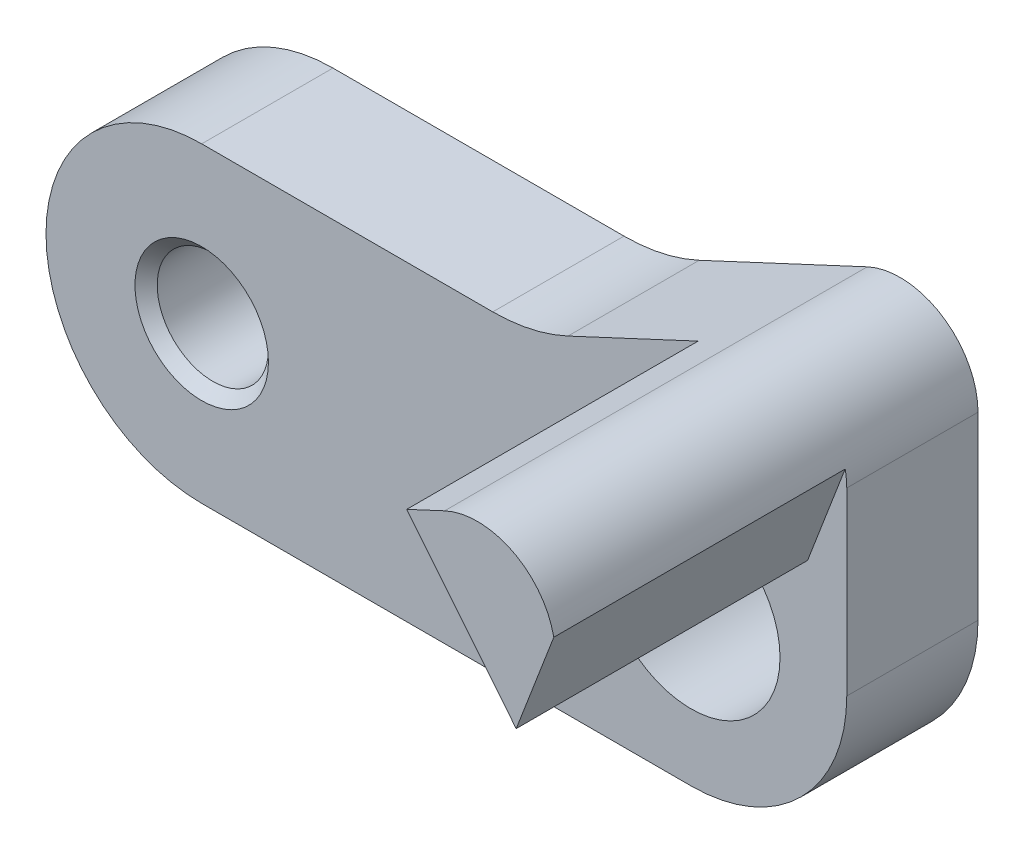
ISO-10303-21;
HEADER;
FILE_DESCRIPTION(('STEP AP214'),'2;1');
FILE_NAME('part.step','',(''),(''),'','','');
FILE_SCHEMA(('AUTOMOTIVE_DESIGN { 1 0 10303 214 1 1 1 1 }'));
ENDSEC;
DATA;
#1=APPLICATION_CONTEXT('core data for automotive mechanical design processes');
#2=APPLICATION_PROTOCOL_DEFINITION('international standard','automotive_design',2000,#1);
#3=PRODUCT_CONTEXT('',#1,'mechanical');
#4=PRODUCT('Part','Part','',(#3));
#5=PRODUCT_RELATED_PRODUCT_CATEGORY('part','',(#4));
#6=PRODUCT_DEFINITION_FORMATION('','',#4);
#7=PRODUCT_DEFINITION_CONTEXT('part definition',#1,'design');
#8=PRODUCT_DEFINITION('design','',#6,#7);
#9=PRODUCT_DEFINITION_SHAPE('','',#8);
#10=(LENGTH_UNIT() NAMED_UNIT(*) SI_UNIT(.MILLI.,.METRE.));
#11=(NAMED_UNIT(*) PLANE_ANGLE_UNIT() SI_UNIT($,.RADIAN.));
#12=(NAMED_UNIT(*) SI_UNIT($,.STERADIAN.) SOLID_ANGLE_UNIT());
#13=UNCERTAINTY_MEASURE_WITH_UNIT(LENGTH_MEASURE(1.E-05),#10,'distance_accuracy_value','');
#14=(GEOMETRIC_REPRESENTATION_CONTEXT(3) GLOBAL_UNCERTAINTY_ASSIGNED_CONTEXT((#13)) GLOBAL_UNIT_ASSIGNED_CONTEXT((#10,
#11,#12)) REPRESENTATION_CONTEXT('',''));
#15=CARTESIAN_POINT('',(0.,0.,0.));
#16=DIRECTION('',(0.,0.,1.));
#17=DIRECTION('',(1.,0.,0.));
#18=AXIS2_PLACEMENT_3D('',#15,#16,#17);
#19=CARTESIAN_POINT('',(1.75,4.05,2.95));
#20=DIRECTION('',(0.,0.,-1.));
#21=DIRECTION('',(-1.,0.,0.));
#22=AXIS2_PLACEMENT_3D('',#19,#20,#21);
#23=PLANE('',#22);
#24=CARTESIAN_POINT('',(-11.,0.,2.95));
#25=DIRECTION('',(0.,0.,1.));
#26=DIRECTION('',(1.,0.,0.));
#27=AXIS2_PLACEMENT_3D('',#24,#25,#26);
#28=CIRCLE('',#27,1.5);
#29=CARTESIAN_POINT('',(-9.5,0.,2.95));
#30=VERTEX_POINT('',#29);
#31=EDGE_CURVE('E289',#30,#30,#28,.T.);
#32=ORIENTED_EDGE('',*,*,#31,.F.);
#33=EDGE_LOOP('',(#32));
#34=FACE_BOUND('',#33,.T.);
#35=CARTESIAN_POINT('',(0.,0.,2.95));
#36=DIRECTION('',(0.,0.,1.));
#37=DIRECTION('',(1.,0.,0.));
#38=AXIS2_PLACEMENT_3D('',#35,#36,#37);
#39=CIRCLE('',#38,2.);
#40=CARTESIAN_POINT('',(2.,0.,2.95));
#41=VERTEX_POINT('',#40);
#42=EDGE_CURVE('E167',#41,#41,#39,.T.);
#43=ORIENTED_EDGE('',*,*,#42,.F.);
#44=EDGE_LOOP('',(#43));
#45=FACE_BOUND('',#44,.T.);
#46=DIRECTION('',(0.35836794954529,0.933580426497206,0.));
#47=VECTOR('',#46,1.);
#48=CARTESIAN_POINT('',(2.61919284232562,2.2,2.95));
#49=LINE('',#48,#47);
#50=CARTESIAN_POINT('',(2.61919284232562,2.2,2.95));
#51=VERTEX_POINT('',#50);
#52=CARTESIAN_POINT('',(3.46431281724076,4.40161280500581,2.95));
#53=VERTEX_POINT('',#52);
#54=EDGE_CURVE('E107',#51,#53,#49,.T.);
#55=ORIENTED_EDGE('',*,*,#54,.F.);
#56=DIRECTION('',(0.629320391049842,-0.777145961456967,0.));
#57=VECTOR('',#56,1.);
#58=CARTESIAN_POINT('',(0.158452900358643,5.23876075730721,2.95));
#59=LINE('',#58,#57);
#60=CARTESIAN_POINT('',(0.158452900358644,5.23876075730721,2.95));
#61=VERTEX_POINT('',#60);
#62=EDGE_CURVE('E43',#61,#51,#59,.T.);
#63=ORIENTED_EDGE('',*,*,#62,.F.);
#64=DIRECTION('',(-0.906307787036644,-0.422618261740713,0.));
#65=VECTOR('',#64,1.);
#66=CARTESIAN_POINT('',(-2.7666371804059,3.87476885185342,2.95));
#67=LINE('',#66,#65);
#68=CARTESIAN_POINT('',(-2.7666371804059,3.87476885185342,2.95));
#69=VERTEX_POINT('',#68);
#70=EDGE_CURVE('E156',#61,#69,#67,.T.);
#71=ORIENTED_EDGE('',*,*,#70,.T.);
#72=CARTESIAN_POINT('',(-4.45711022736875,7.5,2.95));
#73=DIRECTION('',(0.,0.,-1.));
#74=DIRECTION('',(1.,0.,0.));
#75=AXIS2_PLACEMENT_3D('',#72,#73,#74);
#76=CIRCLE('',#75,4.);
#77=CARTESIAN_POINT('',(-4.45711022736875,3.5,2.95));
#78=VERTEX_POINT('',#77);
#79=EDGE_CURVE('E158',#69,#78,#76,.T.);
#80=ORIENTED_EDGE('',*,*,#79,.T.);
#81=DIRECTION('',(-1.,0.,0.));
#82=VECTOR('',#81,1.);
#83=CARTESIAN_POINT('',(-11.,3.5,2.95));
#84=LINE('',#83,#82);
#85=CARTESIAN_POINT('',(-11.,3.5,2.95));
#86=VERTEX_POINT('',#85);
#87=EDGE_CURVE('E187',#78,#86,#84,.T.);
#88=ORIENTED_EDGE('',*,*,#87,.T.);
#89=CARTESIAN_POINT('',(-11.,0.,2.95));
#90=DIRECTION('',(0.,0.,1.));
#91=DIRECTION('',(1.,0.,0.));
#92=AXIS2_PLACEMENT_3D('',#89,#90,#91);
#93=CIRCLE('',#92,3.5);
#94=CARTESIAN_POINT('',(-11.,-3.5,2.95));
#95=VERTEX_POINT('',#94);
#96=EDGE_CURVE('E201',#86,#95,#93,.T.);
#97=ORIENTED_EDGE('',*,*,#96,.T.);
#98=DIRECTION('',(1.,0.,0.));
#99=VECTOR('',#98,1.);
#100=CARTESIAN_POINT('',(0.,-3.5,2.95));
#101=LINE('',#100,#99);
#102=CARTESIAN_POINT('',(0.,-3.5,2.95));
#103=VERTEX_POINT('',#102);
#104=EDGE_CURVE('E203',#95,#103,#101,.T.);
#105=ORIENTED_EDGE('',*,*,#104,.T.);
#106=CARTESIAN_POINT('',(0.,0.,2.95));
#107=DIRECTION('',(0.,0.,1.));
#108=DIRECTION('',(1.,0.,0.));
#109=AXIS2_PLACEMENT_3D('',#106,#107,#108);
#110=CIRCLE('',#109,3.5);
#111=CARTESIAN_POINT('',(3.5,0.,2.95));
#112=VERTEX_POINT('',#111);
#113=EDGE_CURVE('E207',#103,#112,#110,.T.);
#114=ORIENTED_EDGE('',*,*,#113,.T.);
#115=DIRECTION('',(0.,1.,0.));
#116=VECTOR('',#115,1.);
#117=CARTESIAN_POINT('',(3.5,0.,2.95));
#118=LINE('',#117,#116);
#119=CARTESIAN_POINT('',(3.5,4.05,2.95));
#120=VERTEX_POINT('',#119);
#121=EDGE_CURVE('E209',#112,#120,#118,.T.);
#122=ORIENTED_EDGE('',*,*,#121,.T.);
#123=CARTESIAN_POINT('',(1.75,4.05,2.95));
#124=DIRECTION('',(0.,0.,1.));
#125=DIRECTION('',(-1.,0.,0.));
#126=AXIS2_PLACEMENT_3D('',#123,#124,#125);
#127=CIRCLE('',#126,1.75);
#128=EDGE_CURVE('E49',#120,#53,#127,.T.);
#129=ORIENTED_EDGE('',*,*,#128,.T.);
#130=EDGE_LOOP('',(#55,#63,#71,#80,#88,#97,#105,#114,#122,#129));
#131=FACE_BOUND('',#130,.T.);
#132=ADVANCED_FACE('F26',(#34,#45,#131),#23,.F.);
#133=CARTESIAN_POINT('',(1.75,4.05,2.95));
#134=DIRECTION('',(0.,0.,-1.));
#135=DIRECTION('',(-1.,0.,0.));
#136=AXIS2_PLACEMENT_3D('',#133,#134,#135);
#137=CYLINDRICAL_SURFACE('',#136,1.75);
#138=CARTESIAN_POINT('',(1.75,4.05,0.));
#139=DIRECTION('',(0.,0.,1.));
#140=DIRECTION('',(-1.,0.,0.));
#141=AXIS2_PLACEMENT_3D('',#138,#139,#140);
#142=CIRCLE('',#141,1.75);
#143=CARTESIAN_POINT('',(3.5,4.05,0.));
#144=VERTEX_POINT('',#143);
#145=CARTESIAN_POINT('',(1.01041804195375,5.63603862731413,0.));
#146=VERTEX_POINT('',#145);
#147=EDGE_CURVE('E128',#144,#146,#142,.T.);
#148=ORIENTED_EDGE('',*,*,#147,.T.);
#149=DIRECTION('',(0.,0.,-1.));
#150=VECTOR('',#149,1.);
#151=CARTESIAN_POINT('',(1.01041804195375,5.63603862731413,2.95));
#152=LINE('',#151,#150);
#153=CARTESIAN_POINT('',(1.01041804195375,5.63603862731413,9.5));
#154=VERTEX_POINT('',#153);
#155=EDGE_CURVE('E11',#154,#146,#152,.T.);
#156=ORIENTED_EDGE('',*,*,#155,.F.);
#157=CARTESIAN_POINT('',(1.75,4.05,9.5));
#158=DIRECTION('',(0.,0.,1.));
#159=DIRECTION('',(1.,0.,0.));
#160=AXIS2_PLACEMENT_3D('',#157,#158,#159);
#161=CIRCLE('',#160,1.75);
#162=CARTESIAN_POINT('',(3.46431281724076,4.40161280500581,9.5));
#163=VERTEX_POINT('',#162);
#164=EDGE_CURVE('E112',#163,#154,#161,.T.);
#165=ORIENTED_EDGE('',*,*,#164,.F.);
#166=DIRECTION('',(0.,0.,-1.));
#167=VECTOR('',#166,1.);
#168=CARTESIAN_POINT('',(3.46431281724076,4.40161280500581,9.5));
#169=LINE('',#168,#167);
#170=EDGE_CURVE('E126',#163,#53,#169,.T.);
#171=ORIENTED_EDGE('',*,*,#170,.T.);
#172=ORIENTED_EDGE('',*,*,#128,.F.);
#173=DIRECTION('',(0.,0.,-1.));
#174=VECTOR('',#173,1.);
#175=CARTESIAN_POINT('',(3.5,4.05,2.95));
#176=LINE('',#175,#174);
#177=EDGE_CURVE('E211',#120,#144,#176,.T.);
#178=ORIENTED_EDGE('',*,*,#177,.T.);
#179=EDGE_LOOP('',(#148,#156,#165,#171,#172,#178));
#180=FACE_BOUND('',#179,.T.);
#181=ADVANCED_FACE('F28',(#180),#137,.T.);
#182=CARTESIAN_POINT('',(-2.7666371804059,3.87476885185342,2.95));
#183=DIRECTION('',(0.422618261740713,-0.906307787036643,0.));
#184=DIRECTION('',(0.906307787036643,0.422618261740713,0.));
#185=AXIS2_PLACEMENT_3D('',#182,#183,#184);
#186=PLANE('',#185);
#187=DIRECTION('',(-0.906307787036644,-0.422618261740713,0.));
#188=VECTOR('',#187,1.);
#189=CARTESIAN_POINT('',(-2.7666371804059,3.87476885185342,0.));
#190=LINE('',#189,#188);
#191=CARTESIAN_POINT('',(-2.7666371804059,3.87476885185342,0.));
#192=VERTEX_POINT('',#191);
#193=EDGE_CURVE('E136',#146,#192,#190,.T.);
#194=ORIENTED_EDGE('',*,*,#193,.T.);
#195=DIRECTION('',(0.,0.,-1.));
#196=VECTOR('',#195,1.);
#197=CARTESIAN_POINT('',(-2.7666371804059,3.87476885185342,2.95));
#198=LINE('',#197,#196);
#199=EDGE_CURVE('E35',#69,#192,#198,.T.);
#200=ORIENTED_EDGE('',*,*,#199,.F.);
#201=ORIENTED_EDGE('',*,*,#70,.F.);
#202=DIRECTION('',(0.,0.,-1.));
#203=VECTOR('',#202,1.);
#204=CARTESIAN_POINT('',(0.158452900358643,5.23876075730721,9.5));
#205=LINE('',#204,#203);
#206=CARTESIAN_POINT('',(0.158452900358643,5.23876075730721,9.5));
#207=VERTEX_POINT('',#206);
#208=EDGE_CURVE('E122',#207,#61,#205,.T.);
#209=ORIENTED_EDGE('',*,*,#208,.F.);
#210=DIRECTION('',(-0.906307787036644,-0.422618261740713,0.));
#211=VECTOR('',#210,1.);
#212=CARTESIAN_POINT('',(1.01041804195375,5.63603862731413,9.5));
#213=LINE('',#212,#211);
#214=EDGE_CURVE('E171',#154,#207,#213,.T.);
#215=ORIENTED_EDGE('',*,*,#214,.F.);
#216=ORIENTED_EDGE('',*,*,#155,.T.);
#217=EDGE_LOOP('',(#194,#200,#201,#209,#215,#216));
#218=FACE_BOUND('',#217,.T.);
#219=ADVANCED_FACE('F181',(#218),#186,.F.);
#220=CARTESIAN_POINT('',(-4.45711022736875,7.5,2.95));
#221=DIRECTION('',(0.,0.,-1.));
#222=DIRECTION('',(-1.,0.,0.));
#223=AXIS2_PLACEMENT_3D('',#220,#221,#222);
#224=CYLINDRICAL_SURFACE('',#223,4.);
#225=CARTESIAN_POINT('',(-4.45711022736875,7.5,0.));
#226=DIRECTION('',(0.,0.,-1.));
#227=DIRECTION('',(1.,0.,0.));
#228=AXIS2_PLACEMENT_3D('',#225,#226,#227);
#229=CIRCLE('',#228,4.);
#230=CARTESIAN_POINT('',(-4.45711022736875,3.5,0.));
#231=VERTEX_POINT('',#230);
#232=EDGE_CURVE('E138',#192,#231,#229,.T.);
#233=ORIENTED_EDGE('',*,*,#232,.T.);
#234=DIRECTION('',(0.,0.,-1.));
#235=VECTOR('',#234,1.);
#236=CARTESIAN_POINT('',(-4.45711022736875,3.5,2.95));
#237=LINE('',#236,#235);
#238=EDGE_CURVE('E191',#78,#231,#237,.T.);
#239=ORIENTED_EDGE('',*,*,#238,.F.);
#240=ORIENTED_EDGE('',*,*,#79,.F.);
#241=ORIENTED_EDGE('',*,*,#199,.T.);
#242=EDGE_LOOP('',(#233,#239,#240,#241));
#243=FACE_BOUND('',#242,.T.);
#244=ADVANCED_FACE('F192',(#243),#224,.F.);
#245=CARTESIAN_POINT('',(-11.,3.5,2.95));
#246=DIRECTION('',(0.,-1.,0.));
#247=DIRECTION('',(0.,0.,-1.));
#248=AXIS2_PLACEMENT_3D('',#245,#246,#247);
#249=PLANE('',#248);
#250=DIRECTION('',(-1.,0.,0.));
#251=VECTOR('',#250,1.);
#252=CARTESIAN_POINT('',(-11.,3.5,0.));
#253=LINE('',#252,#251);
#254=CARTESIAN_POINT('',(-11.,3.5,0.));
#255=VERTEX_POINT('',#254);
#256=EDGE_CURVE('E140',#231,#255,#253,.T.);
#257=ORIENTED_EDGE('',*,*,#256,.T.);
#258=DIRECTION('',(0.,0.,-1.));
#259=VECTOR('',#258,1.);
#260=CARTESIAN_POINT('',(-11.,3.5,2.95));
#261=LINE('',#260,#259);
#262=EDGE_CURVE('E196',#86,#255,#261,.T.);
#263=ORIENTED_EDGE('',*,*,#262,.F.);
#264=ORIENTED_EDGE('',*,*,#87,.F.);
#265=ORIENTED_EDGE('',*,*,#238,.T.);
#266=EDGE_LOOP('',(#257,#263,#264,#265));
#267=FACE_BOUND('',#266,.T.);
#268=ADVANCED_FACE('F198',(#267),#249,.F.);
#269=CARTESIAN_POINT('',(-11.,0.,2.95));
#270=DIRECTION('',(0.,0.,-1.));
#271=DIRECTION('',(-1.,0.,0.));
#272=AXIS2_PLACEMENT_3D('',#269,#270,#271);
#273=CYLINDRICAL_SURFACE('',#272,3.5);
#274=CARTESIAN_POINT('',(-11.,0.,0.));
#275=DIRECTION('',(0.,0.,1.));
#276=DIRECTION('',(1.,0.,0.));
#277=AXIS2_PLACEMENT_3D('',#274,#275,#276);
#278=CIRCLE('',#277,3.5);
#279=CARTESIAN_POINT('',(-11.,-3.5,0.));
#280=VERTEX_POINT('',#279);
#281=EDGE_CURVE('E142',#255,#280,#278,.T.);
#282=ORIENTED_EDGE('',*,*,#281,.T.);
#283=DIRECTION('',(0.,0.,-1.));
#284=VECTOR('',#283,1.);
#285=CARTESIAN_POINT('',(-11.,-3.5,2.95));
#286=LINE('',#285,#284);
#287=EDGE_CURVE('E219',#95,#280,#286,.T.);
#288=ORIENTED_EDGE('',*,*,#287,.F.);
#289=ORIENTED_EDGE('',*,*,#96,.F.);
#290=ORIENTED_EDGE('',*,*,#262,.T.);
#291=EDGE_LOOP('',(#282,#288,#289,#290));
#292=FACE_BOUND('',#291,.T.);
#293=ADVANCED_FACE('F227',(#292),#273,.T.);
#294=CARTESIAN_POINT('',(0.,-3.5,2.95));
#295=DIRECTION('',(0.,1.,0.));
#296=DIRECTION('',(-1.,0.,0.));
#297=AXIS2_PLACEMENT_3D('',#294,#295,#296);
#298=PLANE('',#297);
#299=DIRECTION('',(1.,0.,0.));
#300=VECTOR('',#299,1.);
#301=CARTESIAN_POINT('',(0.,-3.5,0.));
#302=LINE('',#301,#300);
#303=CARTESIAN_POINT('',(0.,-3.5,0.));
#304=VERTEX_POINT('',#303);
#305=EDGE_CURVE('E144',#280,#304,#302,.T.);
#306=ORIENTED_EDGE('',*,*,#305,.T.);
#307=DIRECTION('',(0.,0.,-1.));
#308=VECTOR('',#307,1.);
#309=CARTESIAN_POINT('',(0.,-3.5,2.95));
#310=LINE('',#309,#308);
#311=EDGE_CURVE('E216',#103,#304,#310,.T.);
#312=ORIENTED_EDGE('',*,*,#311,.F.);
#313=ORIENTED_EDGE('',*,*,#104,.F.);
#314=ORIENTED_EDGE('',*,*,#287,.T.);
#315=EDGE_LOOP('',(#306,#312,#313,#314));
#316=FACE_BOUND('',#315,.T.);
#317=ADVANCED_FACE('F234',(#316),#298,.F.);
#318=CARTESIAN_POINT('',(0.,0.,2.95));
#319=DIRECTION('',(0.,0.,-1.));
#320=DIRECTION('',(-1.,0.,0.));
#321=AXIS2_PLACEMENT_3D('',#318,#319,#320);
#322=CYLINDRICAL_SURFACE('',#321,3.5);
#323=CARTESIAN_POINT('',(0.,0.,0.));
#324=DIRECTION('',(0.,0.,1.));
#325=DIRECTION('',(1.,0.,0.));
#326=AXIS2_PLACEMENT_3D('',#323,#324,#325);
#327=CIRCLE('',#326,3.5);
#328=CARTESIAN_POINT('',(3.5,0.,0.));
#329=VERTEX_POINT('',#328);
#330=EDGE_CURVE('E146',#304,#329,#327,.T.);
#331=ORIENTED_EDGE('',*,*,#330,.T.);
#332=DIRECTION('',(0.,0.,-1.));
#333=VECTOR('',#332,1.);
#334=CARTESIAN_POINT('',(3.5,0.,2.95));
#335=LINE('',#334,#333);
#336=EDGE_CURVE('E213',#112,#329,#335,.T.);
#337=ORIENTED_EDGE('',*,*,#336,.F.);
#338=ORIENTED_EDGE('',*,*,#113,.F.);
#339=ORIENTED_EDGE('',*,*,#311,.T.);
#340=EDGE_LOOP('',(#331,#337,#338,#339));
#341=FACE_BOUND('',#340,.T.);
#342=ADVANCED_FACE('F237',(#341),#322,.T.);
#343=CARTESIAN_POINT('',(3.5,0.,2.95));
#344=DIRECTION('',(-1.,0.,0.));
#345=DIRECTION('',(0.,-1.,0.));
#346=AXIS2_PLACEMENT_3D('',#343,#344,#345);
#347=PLANE('',#346);
#348=DIRECTION('',(0.,1.,0.));
#349=VECTOR('',#348,1.);
#350=CARTESIAN_POINT('',(3.5,0.,0.));
#351=LINE('',#350,#349);
#352=EDGE_CURVE('E148',#329,#144,#351,.T.);
#353=ORIENTED_EDGE('',*,*,#352,.T.);
#354=ORIENTED_EDGE('',*,*,#177,.F.);
#355=ORIENTED_EDGE('',*,*,#121,.F.);
#356=ORIENTED_EDGE('',*,*,#336,.T.);
#357=EDGE_LOOP('',(#353,#354,#355,#356));
#358=FACE_BOUND('',#357,.T.);
#359=ADVANCED_FACE('F242',(#358),#347,.F.);
#360=CARTESIAN_POINT('',(1.75,4.05,0.));
#361=DIRECTION('',(0.,0.,-1.));
#362=DIRECTION('',(-1.,0.,0.));
#363=AXIS2_PLACEMENT_3D('',#360,#361,#362);
#364=PLANE('',#363);
#365=CARTESIAN_POINT('',(-11.,0.,0.));
#366=DIRECTION('',(0.,0.,1.));
#367=DIRECTION('',(1.,0.,0.));
#368=AXIS2_PLACEMENT_3D('',#365,#366,#367);
#369=CIRCLE('',#368,1.5);
#370=CARTESIAN_POINT('',(-9.5,0.,0.));
#371=VERTEX_POINT('',#370);
#372=EDGE_CURVE('E295',#371,#371,#369,.T.);
#373=ORIENTED_EDGE('',*,*,#372,.T.);
#374=EDGE_LOOP('',(#373));
#375=FACE_BOUND('',#374,.T.);
#376=CARTESIAN_POINT('',(0.,0.,0.));
#377=DIRECTION('',(0.,0.,-1.));
#378=DIRECTION('',(-1.,0.,0.));
#379=AXIS2_PLACEMENT_3D('',#376,#377,#378);
#380=CIRCLE('',#379,2.);
#381=CARTESIAN_POINT('',(-2.,0.,0.));
#382=VERTEX_POINT('',#381);
#383=EDGE_CURVE('E30',#382,#382,#380,.T.);
#384=ORIENTED_EDGE('',*,*,#383,.F.);
#385=EDGE_LOOP('',(#384));
#386=FACE_BOUND('',#385,.T.);
#387=ORIENTED_EDGE('',*,*,#147,.F.);
#388=ORIENTED_EDGE('',*,*,#352,.F.);
#389=ORIENTED_EDGE('',*,*,#330,.F.);
#390=ORIENTED_EDGE('',*,*,#305,.F.);
#391=ORIENTED_EDGE('',*,*,#281,.F.);
#392=ORIENTED_EDGE('',*,*,#256,.F.);
#393=ORIENTED_EDGE('',*,*,#232,.F.);
#394=ORIENTED_EDGE('',*,*,#193,.F.);
#395=EDGE_LOOP('',(#387,#388,#389,#390,#391,#392,#393,#394));
#396=FACE_BOUND('',#395,.T.);
#397=ADVANCED_FACE('F223',(#375,#386,#396),#364,.T.);
#398=CARTESIAN_POINT('',(0.158452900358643,5.23876075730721,9.5));
#399=DIRECTION('',(0.777145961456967,0.629320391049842,0.));
#400=DIRECTION('',(-0.629320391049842,0.777145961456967,0.));
#401=AXIS2_PLACEMENT_3D('',#398,#399,#400);
#402=PLANE('',#401);
#403=ORIENTED_EDGE('',*,*,#62,.T.);
#404=DIRECTION('',(0.,0.,-1.));
#405=VECTOR('',#404,1.);
#406=CARTESIAN_POINT('',(2.61919284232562,2.2,9.5));
#407=LINE('',#406,#405);
#408=CARTESIAN_POINT('',(2.61919284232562,2.2,9.5));
#409=VERTEX_POINT('',#408);
#410=EDGE_CURVE('E119',#409,#51,#407,.T.);
#411=ORIENTED_EDGE('',*,*,#410,.F.);
#412=DIRECTION('',(0.629320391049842,-0.777145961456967,0.));
#413=VECTOR('',#412,1.);
#414=CARTESIAN_POINT('',(0.158452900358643,5.23876075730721,9.5));
#415=LINE('',#414,#413);
#416=EDGE_CURVE('E172',#207,#409,#415,.T.);
#417=ORIENTED_EDGE('',*,*,#416,.F.);
#418=ORIENTED_EDGE('',*,*,#208,.T.);
#419=EDGE_LOOP('',(#403,#411,#417,#418));
#420=FACE_BOUND('',#419,.T.);
#421=ADVANCED_FACE('F117',(#420),#402,.F.);
#422=CARTESIAN_POINT('',(2.61919284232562,2.2,9.5));
#423=DIRECTION('',(-0.933580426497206,0.35836794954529,0.));
#424=DIRECTION('',(-0.35836794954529,-0.933580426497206,0.));
#425=AXIS2_PLACEMENT_3D('',#422,#423,#424);
#426=PLANE('',#425);
#427=ORIENTED_EDGE('',*,*,#54,.T.);
#428=ORIENTED_EDGE('',*,*,#170,.F.);
#429=DIRECTION('',(0.35836794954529,0.933580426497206,0.));
#430=VECTOR('',#429,1.);
#431=CARTESIAN_POINT('',(2.61919284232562,2.2,9.5));
#432=LINE('',#431,#430);
#433=EDGE_CURVE('E125',#409,#163,#432,.T.);
#434=ORIENTED_EDGE('',*,*,#433,.F.);
#435=ORIENTED_EDGE('',*,*,#410,.T.);
#436=EDGE_LOOP('',(#427,#428,#434,#435));
#437=FACE_BOUND('',#436,.T.);
#438=ADVANCED_FACE('F124',(#437),#426,.F.);
#439=CARTESIAN_POINT('',(1.75,4.05,9.5));
#440=DIRECTION('',(0.,0.,1.));
#441=DIRECTION('',(1.,0.,0.));
#442=AXIS2_PLACEMENT_3D('',#439,#440,#441);
#443=PLANE('',#442);
#444=ORIENTED_EDGE('',*,*,#164,.T.);
#445=ORIENTED_EDGE('',*,*,#214,.T.);
#446=ORIENTED_EDGE('',*,*,#416,.T.);
#447=ORIENTED_EDGE('',*,*,#433,.T.);
#448=EDGE_LOOP('',(#444,#445,#446,#447));
#449=FACE_BOUND('',#448,.T.);
#450=ADVANCED_FACE('F174',(#449),#443,.T.);
#451=CARTESIAN_POINT('',(0.,0.,-3.6));
#452=DIRECTION('',(0.,0.,1.));
#453=DIRECTION('',(1.,0.,0.));
#454=AXIS2_PLACEMENT_3D('',#451,#452,#453);
#455=CYLINDRICAL_SURFACE('',#454,2.);
#456=ORIENTED_EDGE('',*,*,#383,.T.);
#457=EDGE_LOOP('',(#456));
#458=FACE_BOUND('',#457,.T.);
#459=ORIENTED_EDGE('',*,*,#42,.T.);
#460=EDGE_LOOP('',(#459));
#461=FACE_BOUND('',#460,.T.);
#462=ADVANCED_FACE('F268',(#458,#461),#455,.F.);
#463=CARTESIAN_POINT('',(-11.,0.,0.249999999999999));
#464=DIRECTION('',(0.,0.,-1.));
#465=DIRECTION('',(-1.,0.,0.));
#466=AXIS2_PLACEMENT_3D('',#463,#464,#465);
#467=CONICAL_SURFACE('',#466,1.25,0.785398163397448);
#468=ORIENTED_EDGE('',*,*,#372,.F.);
#469=EDGE_LOOP('',(#468));
#470=FACE_BOUND('',#469,.T.);
#471=CARTESIAN_POINT('',(-11.,0.,0.249999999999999));
#472=DIRECTION('',(0.,0.,1.));
#473=DIRECTION('',(1.,0.,0.));
#474=AXIS2_PLACEMENT_3D('',#471,#472,#473);
#475=CIRCLE('',#474,1.25);
#476=CARTESIAN_POINT('',(-9.75,0.,0.249999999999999));
#477=VERTEX_POINT('',#476);
#478=EDGE_CURVE('E291',#477,#477,#475,.T.);
#479=ORIENTED_EDGE('',*,*,#478,.T.);
#480=EDGE_LOOP('',(#479));
#481=FACE_BOUND('',#480,.T.);
#482=ADVANCED_FACE('F270',(#470,#481),#467,.F.);
#483=CARTESIAN_POINT('',(-11.,0.,2.95));
#484=DIRECTION('',(0.,0.,1.));
#485=DIRECTION('',(1.,0.,0.));
#486=AXIS2_PLACEMENT_3D('',#483,#484,#485);
#487=CYLINDRICAL_SURFACE('',#486,1.24999999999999);
#488=ORIENTED_EDGE('',*,*,#478,.F.);
#489=EDGE_LOOP('',(#488));
#490=FACE_BOUND('',#489,.T.);
#491=CARTESIAN_POINT('',(-11.,0.,2.7));
#492=DIRECTION('',(0.,0.,1.));
#493=DIRECTION('',(1.,0.,0.));
#494=AXIS2_PLACEMENT_3D('',#491,#492,#493);
#495=CIRCLE('',#494,1.24999999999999);
#496=CARTESIAN_POINT('',(-9.75000000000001,0.,2.7));
#497=VERTEX_POINT('',#496);
#498=EDGE_CURVE('E287',#497,#497,#495,.T.);
#499=ORIENTED_EDGE('',*,*,#498,.T.);
#500=EDGE_LOOP('',(#499));
#501=FACE_BOUND('',#500,.T.);
#502=ADVANCED_FACE('F274',(#490,#501),#487,.F.);
#503=CARTESIAN_POINT('',(-11.,0.,2.95));
#504=DIRECTION('',(0.,0.,1.));
#505=DIRECTION('',(1.,0.,0.));
#506=AXIS2_PLACEMENT_3D('',#503,#504,#505);
#507=CONICAL_SURFACE('',#506,1.5,0.785398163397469);
#508=ORIENTED_EDGE('',*,*,#498,.F.);
#509=EDGE_LOOP('',(#508));
#510=FACE_BOUND('',#509,.T.);
#511=ORIENTED_EDGE('',*,*,#31,.T.);
#512=EDGE_LOOP('',(#511));
#513=FACE_BOUND('',#512,.T.);
#514=ADVANCED_FACE('F278',(#510,#513),#507,.F.);
#515=CLOSED_SHELL('',(#132,#181,#219,#244,#268,#293,#317,#342,#359,#397,#421,#438,#450,#462,
#482,#502,#514));
#516=MANIFOLD_SOLID_BREP('B2',#515);
#517=ADVANCED_BREP_SHAPE_REPRESENTATION('',(#18,#516),#14);
#518=SHAPE_DEFINITION_REPRESENTATION(#9,#517);
ENDSEC;
END-ISO-10303-21;
